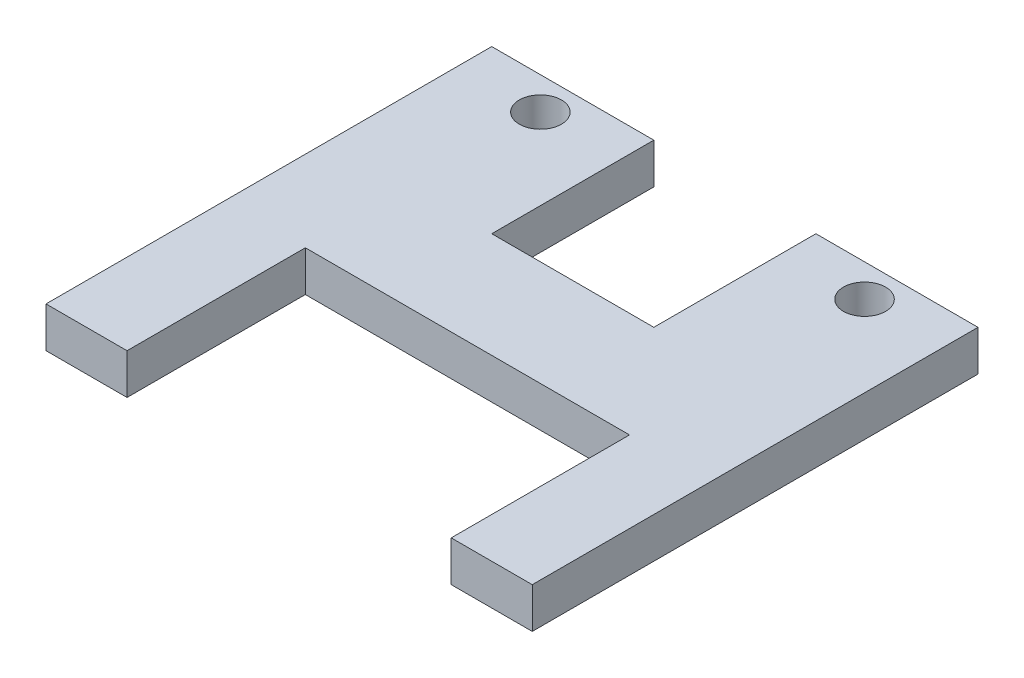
from build123d import *

# Parameters (mm, degrees)
SKETCH1_W           = 76.2
SKETCH1_H           = 69.85
BOSS_EXTRUDE1_DEPTH = 3.175
SKETCH2_W           = 50.8
SKETCH2_H           = 27.94
CUT_EXTRUDE1_DEPTH  = 53.073871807
SKETCH4_R           = 3.302
CUT_EXTRUDE2_DEPTH  = 53.073871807
SKETCH5_W           = 25.4
SKETCH5_H           = 25.4
CUT_EXTRUDE3_DEPTH  = 53.073871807


with BuildPart() as part:
    # Sketch1 → Boss-Extrude1 (new, symmetric)
    with BuildSketch(Plane(origin=(0, 0, 0), x_dir=(1, 0, 0), z_dir=(0, 1, 0))):
        Rectangle(SKETCH1_W, SKETCH1_H)
    extrude(amount=BOSS_EXTRUDE1_DEPTH, both=True)

    # Sketch2 → Cut-Extrude1 (cut, through all)
    with BuildSketch(Plane(origin=(0, 3.175, 0), x_dir=(1, 0, 0), z_dir=(0, 1, 0))):
        with Locations((0, -20.955)):
            Rectangle(SKETCH2_W, SKETCH2_H)
    extrude(amount=-CUT_EXTRUDE1_DEPTH, mode=Mode.SUBTRACT)

    # Sketch4 → Cut-Extrude2 (cut, through all)
    with BuildSketch(Plane(origin=(0, 3.175, 0), x_dir=(1, 0, 0), z_dir=(0, 1, 0))):
        with Locations(Location((-25.4, 29.845, 0), (0, 0, 270))):
            Circle(SKETCH4_R)
        with Locations(Location((25.4, 29.845, 0), (0, 0, 270))):
            Circle(SKETCH4_R)
    extrude(amount=-CUT_EXTRUDE2_DEPTH, mode=Mode.SUBTRACT)

    # Sketch5 → Cut-Extrude3 (cut, through all)
    with BuildSketch(Plane(origin=(0, 3.175, 0), x_dir=(1, 0, 0), z_dir=(0, 1, 0))):
        with Locations((0, 22.225)):
            Rectangle(SKETCH5_W, SKETCH5_H)
    extrude(amount=-CUT_EXTRUDE3_DEPTH, mode=Mode.SUBTRACT)


solid = part.part
